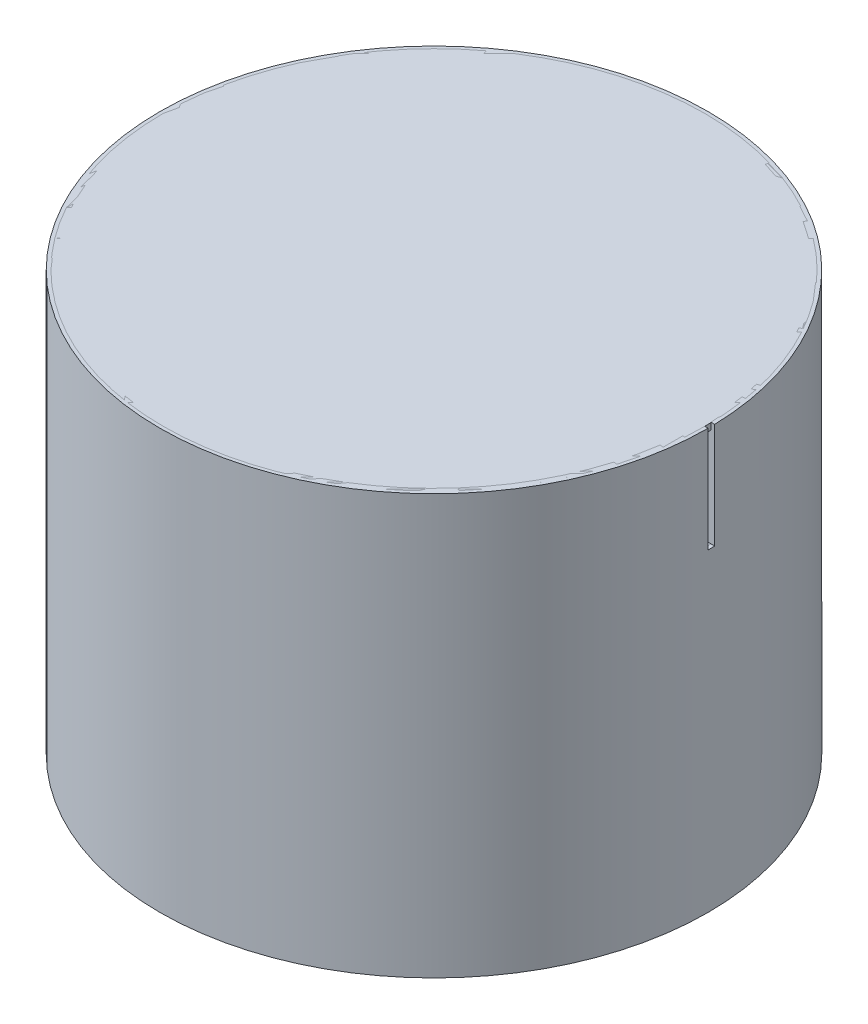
from build123d import *

# Parameters (mm, degrees)
SCHIZZO62_11_W                = 1.2
SCHIZZO62_11_H                = 2.4
SCHIZZO62_27_W                = 32
SCHIZZO62_27_H                = 1.2
SCHIZZO62_28_W                = 1.2
SCHIZZO62_28_H                = 2.4
SCHIZZO62_34_W                = 97.5
SCHIZZO62_34_H                = 2.4
SCHIZZO62_34_W_2              = 1.2
TAGLIO_ESTRUSIONE1_DEPTH      = 207.349654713
TAGLIO_ESTRUSIONE1_DEPTH_BACK = 36


with BuildPart() as part:
    # Schizzo62_11 → Rivoluzione17 (revolve)
    with BuildSketch(Plane.XY, mode=Mode.PRIVATE) as rivoluzione17_sk:
        with Locations((98.1, 39.6)):
            Rectangle(SCHIZZO62_11_W, SCHIZZO62_11_H)
        with Locations((99.3, 39.6)):
            Rectangle(SCHIZZO62_11_W, SCHIZZO62_11_H)
        Polygon((98.7, 38.4), (97.5, 38.4), (97.5, 25.9), (97.5, 2.4), (98.7, 2.4), (99.9, 2.4), (99.9, 38.4), align=None)
        with Locations((98.1, 1.2)):
            Rectangle(SCHIZZO62_11_W, SCHIZZO62_11_H)
        with Locations((99.3, 1.2)):
            Rectangle(SCHIZZO62_11_W, SCHIZZO62_11_H)
        Polygon((98.7, 0), (97.5, 0), (97.5, -112), (99.9, -112), (99.9, 0), align=None)
    revolve(rivoluzione17_sk.sketch.rotate(Axis((0, 18.4, 0), (0, 1, 0)), 90), axis=Axis((0, 18.4, 0), (0, 1, 0)))

    # Schizzo1 → Taglio-Estrusione1 (cut, two sides: drawn at the far end of the back side and taken through both)
    with BuildSketch(Plane(origin=(0, 38.4, 0), x_dir=(1, 0, 0), z_dir=(0, 1, 0)).offset(-TAGLIO_ESTRUSIONE1_DEPTH_BACK)):
        with BuildLine():
            Line((98.670816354, 2.4), (97.470457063, 2.4))
            ThreePointArc((97.470457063, 2.4), (97.492613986, 1.200090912), (97.5, 0))
            Line((97.5, 0), (98.7, 0))
            ThreePointArc((98.7, 0), (98.692703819, 1.200088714), (98.670816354, 2.4))
        make_face()
        with BuildLine():
            Line((99.87116701, 2.4), (98.670816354, 2.4))
            ThreePointArc((98.670816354, 2.4), (98.692703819, 1.200088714), (98.7, 0))
            Line((98.7, 0), (99.9, 0))
            ThreePointArc((99.9, 0), (99.892791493, 1.200086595), (99.87116701, 2.4))
        make_face()
    extrude(amount=TAGLIO_ESTRUSIONE1_DEPTH + TAGLIO_ESTRUSIONE1_DEPTH_BACK, mode=Mode.SUBTRACT)


with BuildPart() as body_2:
    # Schizzo62_27 → Rivoluzione26 (revolve)
    with BuildSketch(Plane.XY, mode=Mode.PRIVATE) as rivoluzione26_sk:
        with Locations((16, 39)):
            Rectangle(SCHIZZO62_27_W, SCHIZZO62_27_H)
    revolve(rivoluzione26_sk.sketch.rotate(Axis((0, 40.8, 0), (0, -1, 0)), 180), axis=Axis((0, 40.8, 0), (0, -1, 0)))


with BuildPart() as body_3:
    # Schizzo62_28 → Rivoluzione27 (revolve)
    with BuildSketch(Plane.XY, mode=Mode.PRIVATE) as rivoluzione27_sk:
        Polygon((32, 38.4), (97.5, 38.4), (97.5, 40.8), (0, 40.8), (0, 39.6), (32, 39.6), align=None)
        with Locations((98.1, 39.6)):
            Rectangle(SCHIZZO62_28_W, SCHIZZO62_28_H)
    revolve(rivoluzione27_sk.sketch.rotate(Axis((0, 18.4, 0), (0, 1, 0)), 90), axis=Axis((0, 18.4, 0), (0, 1, 0)))


with BuildPart() as body_4:
    # Schizzo62_34 → Rivoluzione29 (revolve)
    with BuildSketch(Plane.XY, mode=Mode.PRIVATE) as rivoluzione29_sk:
        with Locations((48.75, 1.2)):
            Rectangle(SCHIZZO62_34_W, SCHIZZO62_34_H)
        with Locations((98.1, 1.2)):
            Rectangle(SCHIZZO62_34_W_2, SCHIZZO62_34_H)
    revolve(rivoluzione29_sk.sketch.rotate(Axis((0, 2.4, 0), (0, -1, 0)), 180), axis=Axis((0, 2.4, 0), (0, -1, 0)))


solid = Compound([part.part, body_2.part, body_3.part, body_4.part])
